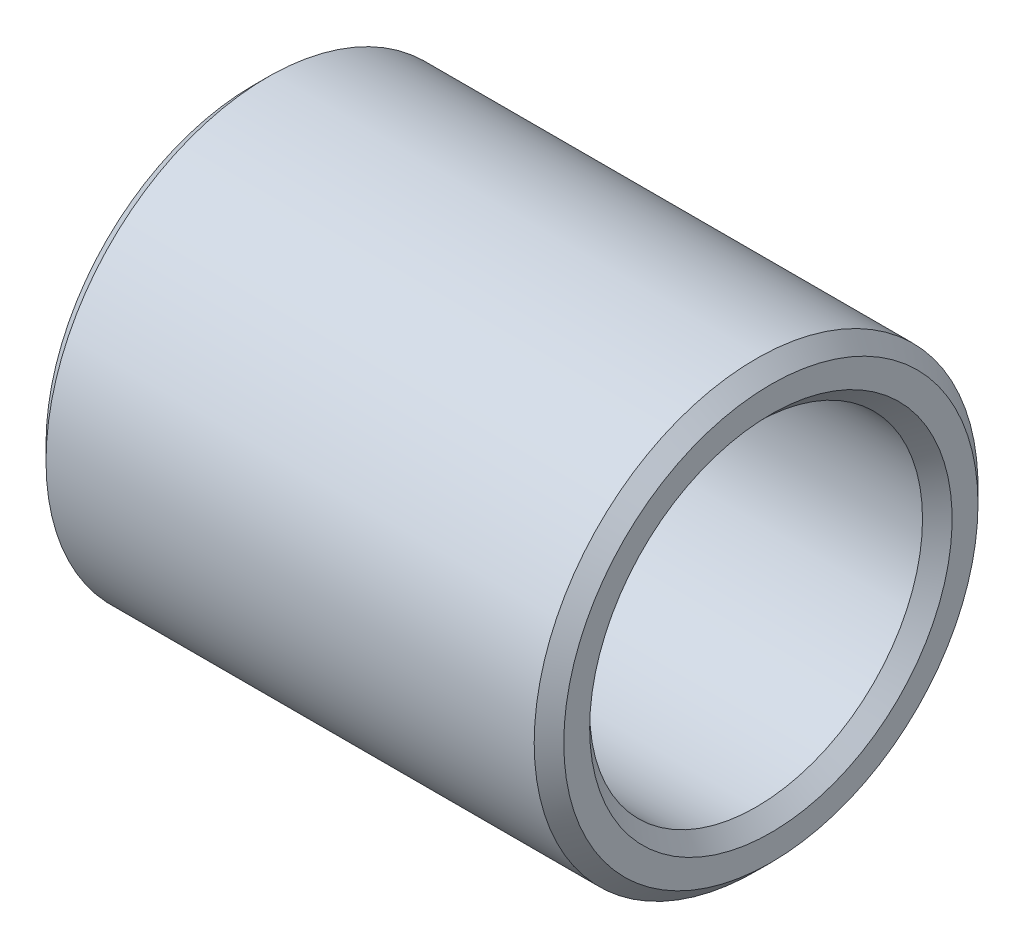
ISO-10303-21;
HEADER;
FILE_DESCRIPTION(('STEP AP214'),'2;1');
FILE_NAME('part.step','',(''),(''),'','','');
FILE_SCHEMA(('AUTOMOTIVE_DESIGN { 1 0 10303 214 1 1 1 1 }'));
ENDSEC;
DATA;
#1=APPLICATION_CONTEXT('core data for automotive mechanical design processes');
#2=APPLICATION_PROTOCOL_DEFINITION('international standard','automotive_design',2000,#1);
#3=PRODUCT_CONTEXT('',#1,'mechanical');
#4=PRODUCT('Part','Part','',(#3));
#5=PRODUCT_RELATED_PRODUCT_CATEGORY('part','',(#4));
#6=PRODUCT_DEFINITION_FORMATION('','',#4);
#7=PRODUCT_DEFINITION_CONTEXT('part definition',#1,'design');
#8=PRODUCT_DEFINITION('design','',#6,#7);
#9=PRODUCT_DEFINITION_SHAPE('','',#8);
#10=(LENGTH_UNIT() NAMED_UNIT(*) SI_UNIT(.MILLI.,.METRE.));
#11=(NAMED_UNIT(*) PLANE_ANGLE_UNIT() SI_UNIT($,.RADIAN.));
#12=(NAMED_UNIT(*) SI_UNIT($,.STERADIAN.) SOLID_ANGLE_UNIT());
#13=UNCERTAINTY_MEASURE_WITH_UNIT(LENGTH_MEASURE(1.E-05),#10,'distance_accuracy_value','');
#14=(GEOMETRIC_REPRESENTATION_CONTEXT(3) GLOBAL_UNCERTAINTY_ASSIGNED_CONTEXT((#13)) GLOBAL_UNIT_ASSIGNED_CONTEXT((#10,
#11,#12)) REPRESENTATION_CONTEXT('',''));
#15=CARTESIAN_POINT('',(0.,0.,0.));
#16=DIRECTION('',(0.,0.,1.));
#17=DIRECTION('',(1.,0.,0.));
#18=AXIS2_PLACEMENT_3D('',#15,#16,#17);
#19=CARTESIAN_POINT('',(-7.,0.,0.));
#20=DIRECTION('',(-1.,0.,0.));
#21=DIRECTION('',(0.,0.,1.));
#22=AXIS2_PLACEMENT_3D('',#19,#20,#21);
#23=CONICAL_SURFACE('',#22,4.9,0.785398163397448);
#24=CARTESIAN_POINT('',(-6.6,0.,0.));
#25=DIRECTION('',(-1.,0.,0.));
#26=DIRECTION('',(0.,0.,1.));
#27=AXIS2_PLACEMENT_3D('',#24,#25,#26);
#28=CIRCLE('',#27,4.5);
#29=CARTESIAN_POINT('',(-6.6,0.,4.5));
#30=VERTEX_POINT('',#29);
#31=EDGE_CURVE('E56',#30,#30,#28,.T.);
#32=ORIENTED_EDGE('',*,*,#31,.F.);
#33=EDGE_LOOP('',(#32));
#34=FACE_BOUND('',#33,.T.);
#35=CARTESIAN_POINT('',(-7.,0.,0.));
#36=DIRECTION('',(-1.,0.,0.));
#37=DIRECTION('',(0.,0.,1.));
#38=AXIS2_PLACEMENT_3D('',#35,#36,#37);
#39=CIRCLE('',#38,4.9);
#40=CARTESIAN_POINT('',(-7.,0.,4.9));
#41=VERTEX_POINT('',#40);
#42=EDGE_CURVE('E10',#41,#41,#39,.T.);
#43=ORIENTED_EDGE('',*,*,#42,.T.);
#44=EDGE_LOOP('',(#43));
#45=FACE_BOUND('',#44,.T.);
#46=ADVANCED_FACE('F28',(#34,#45),#23,.F.);
#47=CARTESIAN_POINT('',(-7.,4.9,0.));
#48=DIRECTION('',(1.,0.,0.));
#49=DIRECTION('',(0.,0.,-1.));
#50=AXIS2_PLACEMENT_3D('',#47,#48,#49);
#51=PLANE('',#50);
#52=ORIENTED_EDGE('',*,*,#42,.F.);
#53=EDGE_LOOP('',(#52));
#54=FACE_BOUND('',#53,.T.);
#55=CARTESIAN_POINT('',(-7.,0.,0.));
#56=DIRECTION('',(-1.,0.,0.));
#57=DIRECTION('',(0.,0.,1.));
#58=AXIS2_PLACEMENT_3D('',#55,#56,#57);
#59=CIRCLE('',#58,5.6);
#60=CARTESIAN_POINT('',(-7.,0.,5.6));
#61=VERTEX_POINT('',#60);
#62=EDGE_CURVE('E34',#61,#61,#59,.T.);
#63=ORIENTED_EDGE('',*,*,#62,.T.);
#64=EDGE_LOOP('',(#63));
#65=FACE_BOUND('',#64,.T.);
#66=ADVANCED_FACE('F63',(#54,#65),#51,.F.);
#67=CARTESIAN_POINT('',(-6.6,0.,0.));
#68=DIRECTION('',(1.,0.,0.));
#69=DIRECTION('',(0.,0.,-1.));
#70=AXIS2_PLACEMENT_3D('',#67,#68,#69);
#71=CONICAL_SURFACE('',#70,6.,0.785398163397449);
#72=ORIENTED_EDGE('',*,*,#62,.F.);
#73=EDGE_LOOP('',(#72));
#74=FACE_BOUND('',#73,.T.);
#75=CARTESIAN_POINT('',(-6.6,0.,0.));
#76=DIRECTION('',(-1.,0.,0.));
#77=DIRECTION('',(0.,0.,1.));
#78=AXIS2_PLACEMENT_3D('',#75,#76,#77);
#79=CIRCLE('',#78,6.);
#80=CARTESIAN_POINT('',(-6.6,0.,6.));
#81=VERTEX_POINT('',#80);
#82=EDGE_CURVE('E38',#81,#81,#79,.T.);
#83=ORIENTED_EDGE('',*,*,#82,.T.);
#84=EDGE_LOOP('',(#83));
#85=FACE_BOUND('',#84,.T.);
#86=ADVANCED_FACE('F67',(#74,#85),#71,.T.);
#87=CARTESIAN_POINT('',(0.,0.,0.));
#88=DIRECTION('',(-1.,0.,0.));
#89=DIRECTION('',(0.,0.,1.));
#90=AXIS2_PLACEMENT_3D('',#87,#88,#89);
#91=CYLINDRICAL_SURFACE('',#90,6.);
#92=ORIENTED_EDGE('',*,*,#82,.F.);
#93=EDGE_LOOP('',(#92));
#94=FACE_BOUND('',#93,.T.);
#95=CARTESIAN_POINT('',(6.6,0.,0.));
#96=DIRECTION('',(-1.,0.,0.));
#97=DIRECTION('',(0.,0.,1.));
#98=AXIS2_PLACEMENT_3D('',#95,#96,#97);
#99=CIRCLE('',#98,6.);
#100=CARTESIAN_POINT('',(6.6,0.,6.));
#101=VERTEX_POINT('',#100);
#102=EDGE_CURVE('E42',#101,#101,#99,.T.);
#103=ORIENTED_EDGE('',*,*,#102,.T.);
#104=EDGE_LOOP('',(#103));
#105=FACE_BOUND('',#104,.T.);
#106=ADVANCED_FACE('F72',(#94,#105),#91,.T.);
#107=CARTESIAN_POINT('',(7.,0.,0.));
#108=DIRECTION('',(-1.,0.,0.));
#109=DIRECTION('',(0.,0.,1.));
#110=AXIS2_PLACEMENT_3D('',#107,#108,#109);
#111=CONICAL_SURFACE('',#110,5.6,0.78539816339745);
#112=ORIENTED_EDGE('',*,*,#102,.F.);
#113=EDGE_LOOP('',(#112));
#114=FACE_BOUND('',#113,.T.);
#115=CARTESIAN_POINT('',(7.,0.,0.));
#116=DIRECTION('',(-1.,0.,0.));
#117=DIRECTION('',(0.,0.,1.));
#118=AXIS2_PLACEMENT_3D('',#115,#116,#117);
#119=CIRCLE('',#118,5.6);
#120=CARTESIAN_POINT('',(7.,0.,5.6));
#121=VERTEX_POINT('',#120);
#122=EDGE_CURVE('E47',#121,#121,#119,.T.);
#123=ORIENTED_EDGE('',*,*,#122,.T.);
#124=EDGE_LOOP('',(#123));
#125=FACE_BOUND('',#124,.T.);
#126=ADVANCED_FACE('F78',(#114,#125),#111,.T.);
#127=CARTESIAN_POINT('',(7.,5.6,0.));
#128=DIRECTION('',(-1.,0.,0.));
#129=DIRECTION('',(0.,0.,1.));
#130=AXIS2_PLACEMENT_3D('',#127,#128,#129);
#131=PLANE('',#130);
#132=ORIENTED_EDGE('',*,*,#122,.F.);
#133=EDGE_LOOP('',(#132));
#134=FACE_BOUND('',#133,.T.);
#135=CARTESIAN_POINT('',(7.,0.,0.));
#136=DIRECTION('',(-1.,0.,0.));
#137=DIRECTION('',(0.,0.,1.));
#138=AXIS2_PLACEMENT_3D('',#135,#136,#137);
#139=CIRCLE('',#138,4.89999999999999);
#140=CARTESIAN_POINT('',(7.,0.,4.89999999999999));
#141=VERTEX_POINT('',#140);
#142=EDGE_CURVE('E50',#141,#141,#139,.T.);
#143=ORIENTED_EDGE('',*,*,#142,.T.);
#144=EDGE_LOOP('',(#143));
#145=FACE_BOUND('',#144,.T.);
#146=ADVANCED_FACE('F82',(#134,#145),#131,.F.);
#147=CARTESIAN_POINT('',(6.6,0.,0.));
#148=DIRECTION('',(1.,0.,0.));
#149=DIRECTION('',(0.,0.,-1.));
#150=AXIS2_PLACEMENT_3D('',#147,#148,#149);
#151=CONICAL_SURFACE('',#150,4.5,0.785398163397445);
#152=ORIENTED_EDGE('',*,*,#142,.F.);
#153=EDGE_LOOP('',(#152));
#154=FACE_BOUND('',#153,.T.);
#155=CARTESIAN_POINT('',(6.6,0.,0.));
#156=DIRECTION('',(-1.,0.,0.));
#157=DIRECTION('',(0.,0.,1.));
#158=AXIS2_PLACEMENT_3D('',#155,#156,#157);
#159=CIRCLE('',#158,4.5);
#160=CARTESIAN_POINT('',(6.6,0.,4.5));
#161=VERTEX_POINT('',#160);
#162=EDGE_CURVE('E53',#161,#161,#159,.T.);
#163=ORIENTED_EDGE('',*,*,#162,.T.);
#164=EDGE_LOOP('',(#163));
#165=FACE_BOUND('',#164,.T.);
#166=ADVANCED_FACE('F86',(#154,#165),#151,.F.);
#167=CARTESIAN_POINT('',(0.,0.,0.));
#168=DIRECTION('',(-1.,0.,0.));
#169=DIRECTION('',(0.,0.,1.));
#170=AXIS2_PLACEMENT_3D('',#167,#168,#169);
#171=CYLINDRICAL_SURFACE('',#170,4.5);
#172=ORIENTED_EDGE('',*,*,#162,.F.);
#173=EDGE_LOOP('',(#172));
#174=FACE_BOUND('',#173,.T.);
#175=ORIENTED_EDGE('',*,*,#31,.T.);
#176=EDGE_LOOP('',(#175));
#177=FACE_BOUND('',#176,.T.);
#178=ADVANCED_FACE('F60',(#174,#177),#171,.F.);
#179=CLOSED_SHELL('',(#46,#66,#86,#106,#126,#146,#166,#178));
#180=MANIFOLD_SOLID_BREP('B2',#179);
#181=ADVANCED_BREP_SHAPE_REPRESENTATION('',(#18,#180),#14);
#182=SHAPE_DEFINITION_REPRESENTATION(#9,#181);
ENDSEC;
END-ISO-10303-21;
